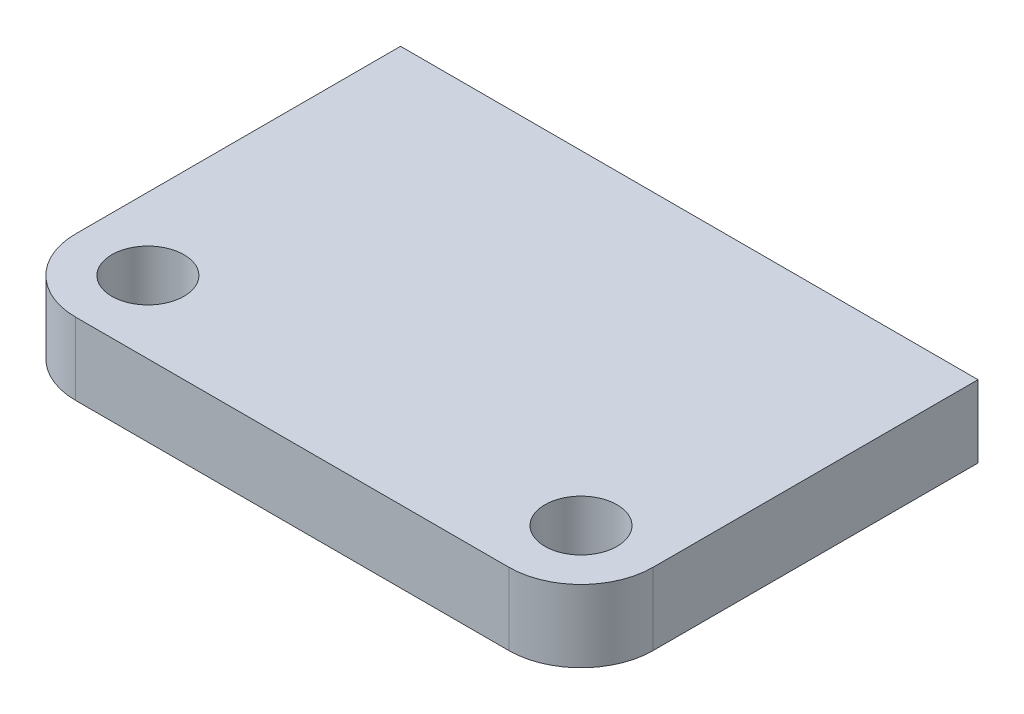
ISO-10303-21;
HEADER;
FILE_DESCRIPTION(('STEP AP214'),'2;1');
FILE_NAME('part.step','',(''),(''),'','','');
FILE_SCHEMA(('AUTOMOTIVE_DESIGN { 1 0 10303 214 1 1 1 1 }'));
ENDSEC;
DATA;
#1=APPLICATION_CONTEXT('core data for automotive mechanical design processes');
#2=APPLICATION_PROTOCOL_DEFINITION('international standard','automotive_design',2000,#1);
#3=PRODUCT_CONTEXT('',#1,'mechanical');
#4=PRODUCT('Part','Part','',(#3));
#5=PRODUCT_RELATED_PRODUCT_CATEGORY('part','',(#4));
#6=PRODUCT_DEFINITION_FORMATION('','',#4);
#7=PRODUCT_DEFINITION_CONTEXT('part definition',#1,'design');
#8=PRODUCT_DEFINITION('design','',#6,#7);
#9=PRODUCT_DEFINITION_SHAPE('','',#8);
#10=(LENGTH_UNIT() NAMED_UNIT(*) SI_UNIT(.MILLI.,.METRE.));
#11=(NAMED_UNIT(*) PLANE_ANGLE_UNIT() SI_UNIT($,.RADIAN.));
#12=(NAMED_UNIT(*) SI_UNIT($,.STERADIAN.) SOLID_ANGLE_UNIT());
#13=UNCERTAINTY_MEASURE_WITH_UNIT(LENGTH_MEASURE(1.E-05),#10,'distance_accuracy_value','');
#14=(GEOMETRIC_REPRESENTATION_CONTEXT(3) GLOBAL_UNCERTAINTY_ASSIGNED_CONTEXT((#13)) GLOBAL_UNIT_ASSIGNED_CONTEXT((#10,
#11,#12)) REPRESENTATION_CONTEXT('',''));
#15=CARTESIAN_POINT('',(0.,0.,0.));
#16=DIRECTION('',(0.,0.,1.));
#17=DIRECTION('',(1.,0.,0.));
#18=AXIS2_PLACEMENT_3D('',#15,#16,#17);
#19=CARTESIAN_POINT('',(-30.,10.,45.));
#20=DIRECTION('',(0.,-1.,0.));
#21=DIRECTION('',(0.,0.,-1.));
#22=AXIS2_PLACEMENT_3D('',#19,#20,#21);
#23=PLANE('',#22);
#24=CARTESIAN_POINT('',(-30.,10.,45.));
#25=DIRECTION('',(0.,1.,0.));
#26=DIRECTION('',(0.,0.,1.));
#27=AXIS2_PLACEMENT_3D('',#24,#25,#26);
#28=CIRCLE('',#27,5.);
#29=CARTESIAN_POINT('',(-30.,10.,50.));
#30=VERTEX_POINT('',#29);
#31=EDGE_CURVE('E119',#30,#30,#28,.T.);
#32=ORIENTED_EDGE('',*,*,#31,.F.);
#33=EDGE_LOOP('',(#32));
#34=FACE_BOUND('',#33,.T.);
#35=DIRECTION('',(0.,0.,1.));
#36=VECTOR('',#35,1.);
#37=CARTESIAN_POINT('',(-40.,10.,0.));
#38=LINE('',#37,#36);
#39=CARTESIAN_POINT('',(-40.,10.,0.));
#40=VERTEX_POINT('',#39);
#41=CARTESIAN_POINT('',(-40.,10.,45.));
#42=VERTEX_POINT('',#41);
#43=EDGE_CURVE('E126',#40,#42,#38,.T.);
#44=ORIENTED_EDGE('',*,*,#43,.T.);
#45=CARTESIAN_POINT('',(-30.,10.,45.));
#46=DIRECTION('',(0.,1.,0.));
#47=DIRECTION('',(0.,0.,-1.));
#48=AXIS2_PLACEMENT_3D('',#45,#46,#47);
#49=CIRCLE('',#48,10.);
#50=CARTESIAN_POINT('',(-30.,10.,55.));
#51=VERTEX_POINT('',#50);
#52=EDGE_CURVE('E84',#42,#51,#49,.T.);
#53=ORIENTED_EDGE('',*,*,#52,.T.);
#54=DIRECTION('',(1.,0.,0.));
#55=VECTOR('',#54,1.);
#56=CARTESIAN_POINT('',(-30.,10.,55.));
#57=LINE('',#56,#55);
#58=CARTESIAN_POINT('',(30.,10.,55.));
#59=VERTEX_POINT('',#58);
#60=EDGE_CURVE('E97',#51,#59,#57,.T.);
#61=ORIENTED_EDGE('',*,*,#60,.T.);
#62=CARTESIAN_POINT('',(30.,10.,45.));
#63=DIRECTION('',(0.,1.,0.));
#64=DIRECTION('',(0.,0.,1.));
#65=AXIS2_PLACEMENT_3D('',#62,#63,#64);
#66=CIRCLE('',#65,10.);
#67=CARTESIAN_POINT('',(40.,10.,45.));
#68=VERTEX_POINT('',#67);
#69=EDGE_CURVE('E91',#59,#68,#66,.T.);
#70=ORIENTED_EDGE('',*,*,#69,.T.);
#71=DIRECTION('',(0.,0.,-1.));
#72=VECTOR('',#71,1.);
#73=CARTESIAN_POINT('',(40.,10.,0.));
#74=LINE('',#73,#72);
#75=CARTESIAN_POINT('',(40.,10.,0.));
#76=VERTEX_POINT('',#75);
#77=EDGE_CURVE('E95',#68,#76,#74,.T.);
#78=ORIENTED_EDGE('',*,*,#77,.T.);
#79=DIRECTION('',(-1.,0.,0.));
#80=VECTOR('',#79,1.);
#81=CARTESIAN_POINT('',(40.,10.,0.));
#82=LINE('',#81,#80);
#83=EDGE_CURVE('E47',#76,#40,#82,.T.);
#84=ORIENTED_EDGE('',*,*,#83,.T.);
#85=EDGE_LOOP('',(#44,#53,#61,#70,#78,#84));
#86=FACE_BOUND('',#85,.T.);
#87=CARTESIAN_POINT('',(30.,10.,45.));
#88=DIRECTION('',(0.,1.,0.));
#89=DIRECTION('',(0.,0.,-1.));
#90=AXIS2_PLACEMENT_3D('',#87,#88,#89);
#91=CIRCLE('',#90,5.);
#92=CARTESIAN_POINT('',(30.,10.,40.));
#93=VERTEX_POINT('',#92);
#94=EDGE_CURVE('E169',#93,#93,#91,.T.);
#95=ORIENTED_EDGE('',*,*,#94,.F.);
#96=EDGE_LOOP('',(#95));
#97=FACE_BOUND('',#96,.T.);
#98=ADVANCED_FACE('F30',(#34,#86,#97),#23,.F.);
#99=CARTESIAN_POINT('',(-30.,0.,45.));
#100=DIRECTION('',(0.,-1.,0.));
#101=DIRECTION('',(0.,0.,-1.));
#102=AXIS2_PLACEMENT_3D('',#99,#100,#101);
#103=PLANE('',#102);
#104=CARTESIAN_POINT('',(-30.,0.,45.));
#105=DIRECTION('',(0.,1.,0.));
#106=DIRECTION('',(0.,0.,1.));
#107=AXIS2_PLACEMENT_3D('',#104,#105,#106);
#108=CIRCLE('',#107,5.);
#109=CARTESIAN_POINT('',(-30.,0.,50.));
#110=VERTEX_POINT('',#109);
#111=EDGE_CURVE('E174',#110,#110,#108,.T.);
#112=ORIENTED_EDGE('',*,*,#111,.T.);
#113=EDGE_LOOP('',(#112));
#114=FACE_BOUND('',#113,.T.);
#115=DIRECTION('',(0.,0.,1.));
#116=VECTOR('',#115,1.);
#117=CARTESIAN_POINT('',(-40.,0.,0.));
#118=LINE('',#117,#116);
#119=CARTESIAN_POINT('',(-40.,0.,0.));
#120=VERTEX_POINT('',#119);
#121=CARTESIAN_POINT('',(-40.,0.,45.));
#122=VERTEX_POINT('',#121);
#123=EDGE_CURVE('E115',#120,#122,#118,.T.);
#124=ORIENTED_EDGE('',*,*,#123,.F.);
#125=DIRECTION('',(-1.,0.,0.));
#126=VECTOR('',#125,1.);
#127=CARTESIAN_POINT('',(40.,0.,0.));
#128=LINE('',#127,#126);
#129=CARTESIAN_POINT('',(40.,0.,0.));
#130=VERTEX_POINT('',#129);
#131=EDGE_CURVE('E76',#130,#120,#128,.T.);
#132=ORIENTED_EDGE('',*,*,#131,.F.);
#133=DIRECTION('',(0.,0.,-1.));
#134=VECTOR('',#133,1.);
#135=CARTESIAN_POINT('',(40.,0.,0.));
#136=LINE('',#135,#134);
#137=CARTESIAN_POINT('',(40.,0.,45.));
#138=VERTEX_POINT('',#137);
#139=EDGE_CURVE('E70',#138,#130,#136,.T.);
#140=ORIENTED_EDGE('',*,*,#139,.F.);
#141=CARTESIAN_POINT('',(30.,0.,45.));
#142=DIRECTION('',(0.,1.,0.));
#143=DIRECTION('',(0.,0.,1.));
#144=AXIS2_PLACEMENT_3D('',#141,#142,#143);
#145=CIRCLE('',#144,10.);
#146=CARTESIAN_POINT('',(30.,0.,55.));
#147=VERTEX_POINT('',#146);
#148=EDGE_CURVE('E105',#147,#138,#145,.T.);
#149=ORIENTED_EDGE('',*,*,#148,.F.);
#150=DIRECTION('',(1.,0.,0.));
#151=VECTOR('',#150,1.);
#152=CARTESIAN_POINT('',(-30.,0.,55.));
#153=LINE('',#152,#151);
#154=CARTESIAN_POINT('',(-30.,0.,55.));
#155=VERTEX_POINT('',#154);
#156=EDGE_CURVE('E121',#155,#147,#153,.T.);
#157=ORIENTED_EDGE('',*,*,#156,.F.);
#158=CARTESIAN_POINT('',(-30.,0.,45.));
#159=DIRECTION('',(0.,1.,0.));
#160=DIRECTION('',(0.,0.,-1.));
#161=AXIS2_PLACEMENT_3D('',#158,#159,#160);
#162=CIRCLE('',#161,10.);
#163=EDGE_CURVE('E118',#122,#155,#162,.T.);
#164=ORIENTED_EDGE('',*,*,#163,.F.);
#165=EDGE_LOOP('',(#124,#132,#140,#149,#157,#164));
#166=FACE_BOUND('',#165,.T.);
#167=CARTESIAN_POINT('',(30.,0.,45.));
#168=DIRECTION('',(0.,1.,0.));
#169=DIRECTION('',(0.,0.,-1.));
#170=AXIS2_PLACEMENT_3D('',#167,#168,#169);
#171=CIRCLE('',#170,5.);
#172=CARTESIAN_POINT('',(30.,0.,40.));
#173=VERTEX_POINT('',#172);
#174=EDGE_CURVE('E172',#173,#173,#171,.T.);
#175=ORIENTED_EDGE('',*,*,#174,.T.);
#176=EDGE_LOOP('',(#175));
#177=FACE_BOUND('',#176,.T.);
#178=ADVANCED_FACE('F135',(#114,#166,#177),#103,.T.);
#179=CARTESIAN_POINT('',(-40.,10.,0.));
#180=DIRECTION('',(1.,0.,0.));
#181=DIRECTION('',(0.,0.,-1.));
#182=AXIS2_PLACEMENT_3D('',#179,#180,#181);
#183=PLANE('',#182);
#184=ORIENTED_EDGE('',*,*,#123,.T.);
#185=DIRECTION('',(0.,-1.,0.));
#186=VECTOR('',#185,1.);
#187=CARTESIAN_POINT('',(-40.,10.,45.));
#188=LINE('',#187,#186);
#189=EDGE_CURVE('E11',#42,#122,#188,.T.);
#190=ORIENTED_EDGE('',*,*,#189,.F.);
#191=ORIENTED_EDGE('',*,*,#43,.F.);
#192=DIRECTION('',(0.,-1.,0.));
#193=VECTOR('',#192,1.);
#194=CARTESIAN_POINT('',(-40.,10.,0.));
#195=LINE('',#194,#193);
#196=EDGE_CURVE('E111',#40,#120,#195,.T.);
#197=ORIENTED_EDGE('',*,*,#196,.T.);
#198=EDGE_LOOP('',(#184,#190,#191,#197));
#199=FACE_BOUND('',#198,.T.);
#200=ADVANCED_FACE('F32',(#199),#183,.F.);
#201=CARTESIAN_POINT('',(-30.,10.,45.));
#202=DIRECTION('',(0.,-1.,0.));
#203=DIRECTION('',(0.,0.,-1.));
#204=AXIS2_PLACEMENT_3D('',#201,#202,#203);
#205=CYLINDRICAL_SURFACE('',#204,10.);
#206=ORIENTED_EDGE('',*,*,#163,.T.);
#207=DIRECTION('',(0.,-1.,0.));
#208=VECTOR('',#207,1.);
#209=CARTESIAN_POINT('',(-30.,10.,55.));
#210=LINE('',#209,#208);
#211=EDGE_CURVE('E39',#51,#155,#210,.T.);
#212=ORIENTED_EDGE('',*,*,#211,.F.);
#213=ORIENTED_EDGE('',*,*,#52,.F.);
#214=ORIENTED_EDGE('',*,*,#189,.T.);
#215=EDGE_LOOP('',(#206,#212,#213,#214));
#216=FACE_BOUND('',#215,.T.);
#217=ADVANCED_FACE('F215',(#216),#205,.T.);
#218=CARTESIAN_POINT('',(-30.,10.,55.));
#219=DIRECTION('',(0.,0.,-1.));
#220=DIRECTION('',(-1.,0.,0.));
#221=AXIS2_PLACEMENT_3D('',#218,#219,#220);
#222=PLANE('',#221);
#223=ORIENTED_EDGE('',*,*,#156,.T.);
#224=DIRECTION('',(0.,-1.,0.));
#225=VECTOR('',#224,1.);
#226=CARTESIAN_POINT('',(30.,10.,55.));
#227=LINE('',#226,#225);
#228=EDGE_CURVE('E106',#59,#147,#227,.T.);
#229=ORIENTED_EDGE('',*,*,#228,.F.);
#230=ORIENTED_EDGE('',*,*,#60,.F.);
#231=ORIENTED_EDGE('',*,*,#211,.T.);
#232=EDGE_LOOP('',(#223,#229,#230,#231));
#233=FACE_BOUND('',#232,.T.);
#234=ADVANCED_FACE('F132',(#233),#222,.F.);
#235=CARTESIAN_POINT('',(30.,10.,45.));
#236=DIRECTION('',(0.,-1.,0.));
#237=DIRECTION('',(0.,0.,-1.));
#238=AXIS2_PLACEMENT_3D('',#235,#236,#237);
#239=CYLINDRICAL_SURFACE('',#238,10.);
#240=ORIENTED_EDGE('',*,*,#148,.T.);
#241=DIRECTION('',(0.,-1.,0.));
#242=VECTOR('',#241,1.);
#243=CARTESIAN_POINT('',(40.,10.,45.));
#244=LINE('',#243,#242);
#245=EDGE_CURVE('E102',#68,#138,#244,.T.);
#246=ORIENTED_EDGE('',*,*,#245,.F.);
#247=ORIENTED_EDGE('',*,*,#69,.F.);
#248=ORIENTED_EDGE('',*,*,#228,.T.);
#249=EDGE_LOOP('',(#240,#246,#247,#248));
#250=FACE_BOUND('',#249,.T.);
#251=ADVANCED_FACE('F103',(#250),#239,.T.);
#252=CARTESIAN_POINT('',(40.,10.,0.));
#253=DIRECTION('',(-1.,0.,0.));
#254=DIRECTION('',(0.,0.,1.));
#255=AXIS2_PLACEMENT_3D('',#252,#253,#254);
#256=PLANE('',#255);
#257=ORIENTED_EDGE('',*,*,#139,.T.);
#258=DIRECTION('',(0.,-1.,0.));
#259=VECTOR('',#258,1.);
#260=CARTESIAN_POINT('',(40.,10.,0.));
#261=LINE('',#260,#259);
#262=EDGE_CURVE('E107',#76,#130,#261,.T.);
#263=ORIENTED_EDGE('',*,*,#262,.F.);
#264=ORIENTED_EDGE('',*,*,#77,.F.);
#265=ORIENTED_EDGE('',*,*,#245,.T.);
#266=EDGE_LOOP('',(#257,#263,#264,#265));
#267=FACE_BOUND('',#266,.T.);
#268=ADVANCED_FACE('F109',(#267),#256,.F.);
#269=CARTESIAN_POINT('',(40.,10.,0.));
#270=DIRECTION('',(0.,0.,1.));
#271=DIRECTION('',(1.,0.,0.));
#272=AXIS2_PLACEMENT_3D('',#269,#270,#271);
#273=PLANE('',#272);
#274=ORIENTED_EDGE('',*,*,#131,.T.);
#275=ORIENTED_EDGE('',*,*,#196,.F.);
#276=ORIENTED_EDGE('',*,*,#83,.F.);
#277=ORIENTED_EDGE('',*,*,#262,.T.);
#278=EDGE_LOOP('',(#274,#275,#276,#277));
#279=FACE_BOUND('',#278,.T.);
#280=ADVANCED_FACE('F140',(#279),#273,.F.);
#281=CARTESIAN_POINT('',(-30.,10.,45.));
#282=DIRECTION('',(0.,-1.,0.));
#283=DIRECTION('',(0.,0.,-1.));
#284=AXIS2_PLACEMENT_3D('',#281,#282,#283);
#285=CYLINDRICAL_SURFACE('',#284,5.);
#286=ORIENTED_EDGE('',*,*,#31,.T.);
#287=EDGE_LOOP('',(#286));
#288=FACE_BOUND('',#287,.T.);
#289=ORIENTED_EDGE('',*,*,#111,.F.);
#290=EDGE_LOOP('',(#289));
#291=FACE_BOUND('',#290,.T.);
#292=ADVANCED_FACE('F142',(#288,#291),#285,.F.);
#293=CARTESIAN_POINT('',(30.,10.,45.));
#294=DIRECTION('',(0.,-1.,0.));
#295=DIRECTION('',(0.,0.,-1.));
#296=AXIS2_PLACEMENT_3D('',#293,#294,#295);
#297=CYLINDRICAL_SURFACE('',#296,5.);
#298=ORIENTED_EDGE('',*,*,#94,.T.);
#299=EDGE_LOOP('',(#298));
#300=FACE_BOUND('',#299,.T.);
#301=ORIENTED_EDGE('',*,*,#174,.F.);
#302=EDGE_LOOP('',(#301));
#303=FACE_BOUND('',#302,.T.);
#304=ADVANCED_FACE('F148',(#300,#303),#297,.F.);
#305=CLOSED_SHELL('',(#98,#178,#200,#217,#234,#251,#268,#280,#292,#304));
#306=MANIFOLD_SOLID_BREP('B2',#305);
#307=ADVANCED_BREP_SHAPE_REPRESENTATION('',(#18,#306),#14);
#308=SHAPE_DEFINITION_REPRESENTATION(#9,#307);
ENDSEC;
END-ISO-10303-21;
